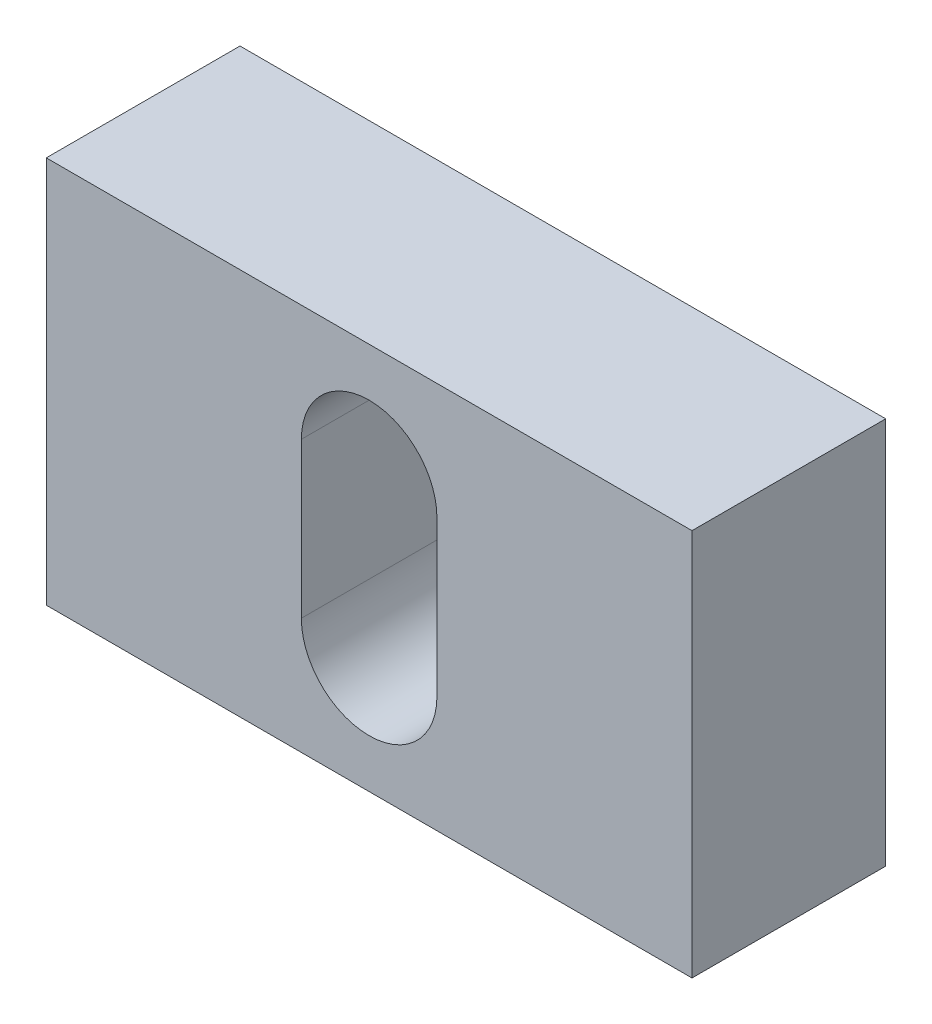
from build123d import *

# Parameters (mm, degrees)
ESQUISSE1_W      = 20
ESQUISSE1_H      = 12
EXTRUSION1_DEPTH = 6


with BuildPart() as part:
    # Esquisse1 → Extrusion1 (new body)
    with BuildSketch(Plane.XY):
        Rectangle(ESQUISSE1_W, ESQUISSE1_H)
        with BuildLine():
            Line((-2.1, 2.4), (-2.1, -2.4))
            ThreePointArc((-2.1, -2.4), (0, -4.5), (2.1, -2.4))
            Line((2.1, -2.4), (2.1, 2.4))
            ThreePointArc((2.1, 2.4), (0, 4.5), (-2.1, 2.4))
        make_face(mode=Mode.SUBTRACT)
    extrude(amount=EXTRUSION1_DEPTH)


solid = part.part
